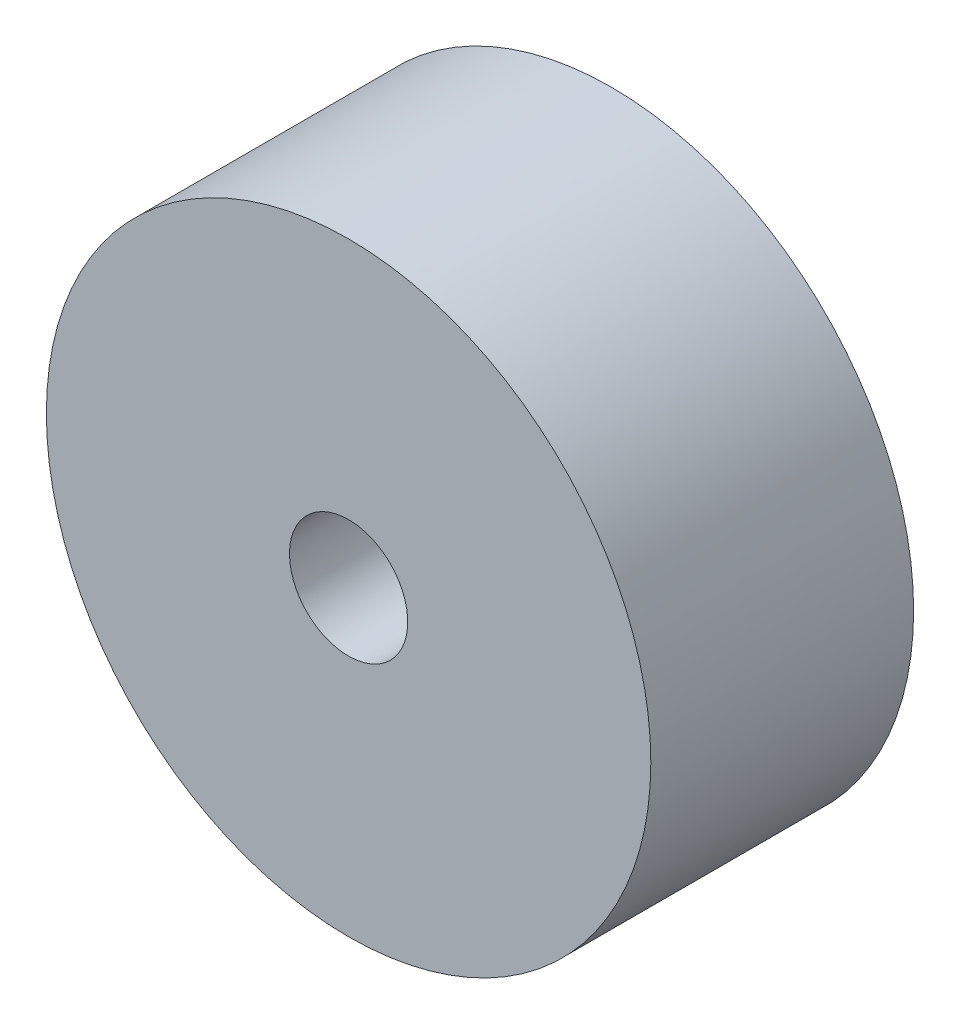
from build123d import *

# Parameters (mm, degrees)
SKETCH1_R           = 11.5
BOSS_EXTRUDE1_DEPTH = 10
SKETCH2_R           = 8.5
CUT_EXTRUDE1_DEPTH  = 5
SKETCH3_R           = 2.25
CUT_EXTRUDE2_DEPTH  = 18.014699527


with BuildPart() as part:
    # Sketch1 → Boss-Extrude1 (new body)
    with BuildSketch(Plane.XY):
        Circle(SKETCH1_R)
    extrude(amount=BOSS_EXTRUDE1_DEPTH)

    # Sketch2 → Cut-Extrude1 (cut)
    with BuildSketch(Plane(origin=(0, 0, 0), x_dir=(-1, 0, 0), z_dir=(0, 0, -1))):
        Circle(SKETCH2_R)
    extrude(amount=-CUT_EXTRUDE1_DEPTH, mode=Mode.SUBTRACT)

    # Sketch3 → Cut-Extrude2 (cut, through all)
    with BuildSketch(Plane(origin=(0, 0, 5), x_dir=(-1, 0, 0), z_dir=(0, 0, -1))):
        Circle(SKETCH3_R)
    extrude(amount=-CUT_EXTRUDE2_DEPTH, mode=Mode.SUBTRACT)


solid = part.part
